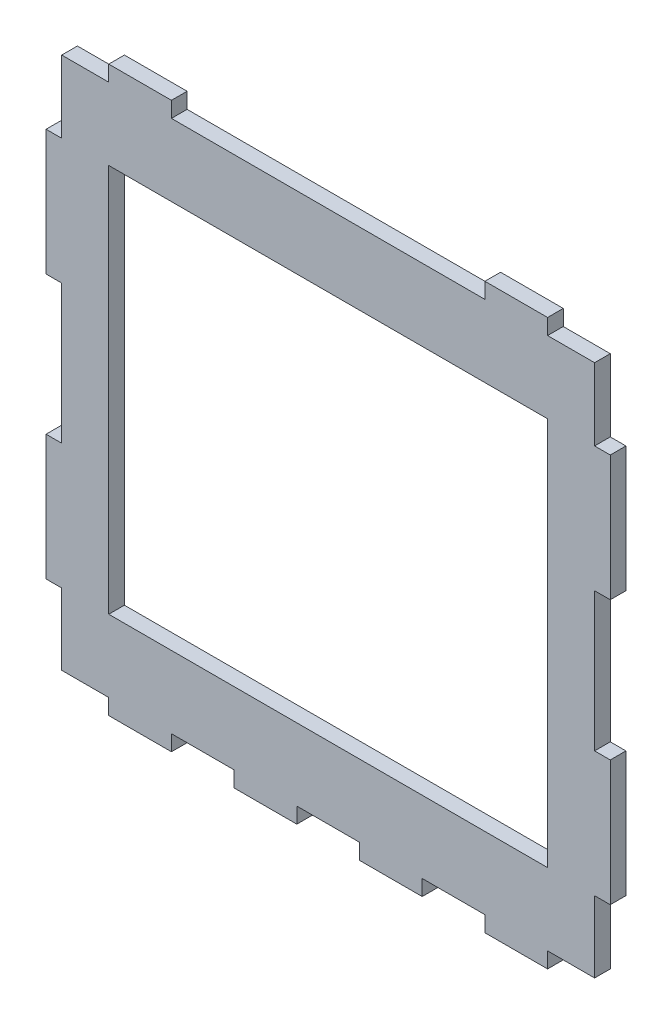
ISO-10303-21;
HEADER;
FILE_DESCRIPTION(('STEP AP214'),'2;1');
FILE_NAME('part.step','',(''),(''),'','','');
FILE_SCHEMA(('AUTOMOTIVE_DESIGN { 1 0 10303 214 1 1 1 1 }'));
ENDSEC;
DATA;
#1=APPLICATION_CONTEXT('core data for automotive mechanical design processes');
#2=APPLICATION_PROTOCOL_DEFINITION('international standard','automotive_design',2000,#1);
#3=PRODUCT_CONTEXT('',#1,'mechanical');
#4=PRODUCT('Part','Part','',(#3));
#5=PRODUCT_RELATED_PRODUCT_CATEGORY('part','',(#4));
#6=PRODUCT_DEFINITION_FORMATION('','',#4);
#7=PRODUCT_DEFINITION_CONTEXT('part definition',#1,'design');
#8=PRODUCT_DEFINITION('design','',#6,#7);
#9=PRODUCT_DEFINITION_SHAPE('','',#8);
#10=(LENGTH_UNIT() NAMED_UNIT(*) SI_UNIT(.MILLI.,.METRE.));
#11=(NAMED_UNIT(*) PLANE_ANGLE_UNIT() SI_UNIT($,.RADIAN.));
#12=(NAMED_UNIT(*) SI_UNIT($,.STERADIAN.) SOLID_ANGLE_UNIT());
#13=UNCERTAINTY_MEASURE_WITH_UNIT(LENGTH_MEASURE(1.E-05),#10,'distance_accuracy_value','');
#14=(GEOMETRIC_REPRESENTATION_CONTEXT(3) GLOBAL_UNCERTAINTY_ASSIGNED_CONTEXT((#13)) GLOBAL_UNIT_ASSIGNED_CONTEXT((#10,
#11,#12)) REPRESENTATION_CONTEXT('',''));
#15=CARTESIAN_POINT('',(0.,0.,0.));
#16=DIRECTION('',(0.,0.,1.));
#17=DIRECTION('',(1.,0.,0.));
#18=AXIS2_PLACEMENT_3D('',#15,#16,#17);
#19=CARTESIAN_POINT('',(0.,111.125,3.175));
#20=DIRECTION('',(0.,1.,0.));
#21=DIRECTION('',(0.,0.,1.));
#22=AXIS2_PLACEMENT_3D('',#19,#20,#21);
#23=PLANE('',#22);
#24=DIRECTION('',(1.,0.,0.));
#25=VECTOR('',#24,1.);
#26=CARTESIAN_POINT('',(0.,111.125,0.));
#27=LINE('',#26,#25);
#28=CARTESIAN_POINT('',(-111.125,111.125,0.));
#29=VERTEX_POINT('',#28);
#30=CARTESIAN_POINT('',(-101.6,111.125,0.));
#31=VERTEX_POINT('',#30);
#32=EDGE_CURVE('E684',#29,#31,#27,.T.);
#33=ORIENTED_EDGE('',*,*,#32,.F.);
#34=DIRECTION('',(0.,0.,1.));
#35=VECTOR('',#34,1.);
#36=CARTESIAN_POINT('',(-111.125,111.125,0.));
#37=LINE('',#36,#35);
#38=CARTESIAN_POINT('',(-111.125,111.125,3.175));
#39=VERTEX_POINT('',#38);
#40=EDGE_CURVE('E521',#29,#39,#37,.T.);
#41=ORIENTED_EDGE('',*,*,#40,.T.);
#42=DIRECTION('',(1.,0.,0.));
#43=VECTOR('',#42,1.);
#44=CARTESIAN_POINT('',(0.,111.125,3.175));
#45=LINE('',#44,#43);
#46=CARTESIAN_POINT('',(-101.6,111.125,3.175));
#47=VERTEX_POINT('',#46);
#48=EDGE_CURVE('E571',#39,#47,#45,.T.);
#49=ORIENTED_EDGE('',*,*,#48,.T.);
#50=DIRECTION('',(0.,0.,-1.));
#51=VECTOR('',#50,1.);
#52=CARTESIAN_POINT('',(-101.6,111.125,3.175));
#53=LINE('',#52,#51);
#54=EDGE_CURVE('E827',#47,#31,#53,.T.);
#55=ORIENTED_EDGE('',*,*,#54,.T.);
#56=EDGE_LOOP('',(#33,#41,#49,#55));
#57=FACE_BOUND('',#56,.T.);
#58=ADVANCED_FACE('F49',(#57),#23,.T.);
#59=CARTESIAN_POINT('',(-114.3,0.,3.175));
#60=DIRECTION('',(-1.,0.,0.));
#61=DIRECTION('',(0.,0.,1.));
#62=AXIS2_PLACEMENT_3D('',#59,#60,#61);
#63=PLANE('',#62);
#64=DIRECTION('',(0.,1.,0.));
#65=VECTOR('',#64,1.);
#66=CARTESIAN_POINT('',(-114.3,0.,0.));
#67=LINE('',#66,#65);
#68=CARTESIAN_POINT('',(-114.3,17.62,0.));
#69=VERTEX_POINT('',#68);
#70=CARTESIAN_POINT('',(-114.3,43.02,0.));
#71=VERTEX_POINT('',#70);
#72=EDGE_CURVE('E690',#69,#71,#67,.T.);
#73=ORIENTED_EDGE('',*,*,#72,.F.);
#74=DIRECTION('',(0.,0.,1.));
#75=VECTOR('',#74,1.);
#76=CARTESIAN_POINT('',(-114.3,17.62,0.));
#77=LINE('',#76,#75);
#78=CARTESIAN_POINT('',(-114.3,17.62,3.175));
#79=VERTEX_POINT('',#78);
#80=EDGE_CURVE('E426',#69,#79,#77,.T.);
#81=ORIENTED_EDGE('',*,*,#80,.T.);
#82=DIRECTION('',(0.,1.,0.));
#83=VECTOR('',#82,1.);
#84=CARTESIAN_POINT('',(-114.3,0.,3.175));
#85=LINE('',#84,#83);
#86=CARTESIAN_POINT('',(-114.3,43.02,3.175));
#87=VERTEX_POINT('',#86);
#88=EDGE_CURVE('E578',#79,#87,#85,.T.);
#89=ORIENTED_EDGE('',*,*,#88,.T.);
#90=DIRECTION('',(0.,0.,1.));
#91=VECTOR('',#90,1.);
#92=CARTESIAN_POINT('',(-114.3,43.02,0.));
#93=LINE('',#92,#91);
#94=EDGE_CURVE('E403',#71,#87,#93,.T.);
#95=ORIENTED_EDGE('',*,*,#94,.F.);
#96=EDGE_LOOP('',(#73,#81,#89,#95));
#97=FACE_BOUND('',#96,.T.);
#98=ADVANCED_FACE('F873',(#97),#63,.T.);
#99=CARTESIAN_POINT('',(0.,3.175,3.175));
#100=DIRECTION('',(0.,-1.,0.));
#101=DIRECTION('',(1.,0.,0.));
#102=AXIS2_PLACEMENT_3D('',#99,#100,#101);
#103=PLANE('',#102);
#104=DIRECTION('',(-1.,0.,0.));
#105=VECTOR('',#104,1.);
#106=CARTESIAN_POINT('',(0.,3.175,3.175));
#107=LINE('',#106,#105);
#108=CARTESIAN_POINT('',(-101.6,3.17499999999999,3.175));
#109=VERTEX_POINT('',#108);
#110=CARTESIAN_POINT('',(-111.125,3.17499999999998,3.175));
#111=VERTEX_POINT('',#110);
#112=EDGE_CURVE('E579',#109,#111,#107,.T.);
#113=ORIENTED_EDGE('',*,*,#112,.T.);
#114=DIRECTION('',(0.,0.,1.));
#115=VECTOR('',#114,1.);
#116=CARTESIAN_POINT('',(-111.125,3.17499999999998,0.));
#117=LINE('',#116,#115);
#118=CARTESIAN_POINT('',(-111.125,3.17499999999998,0.));
#119=VERTEX_POINT('',#118);
#120=EDGE_CURVE('E396',#119,#111,#117,.T.);
#121=ORIENTED_EDGE('',*,*,#120,.F.);
#122=DIRECTION('',(-1.,0.,0.));
#123=VECTOR('',#122,1.);
#124=CARTESIAN_POINT('',(0.,3.175,0.));
#125=LINE('',#124,#123);
#126=CARTESIAN_POINT('',(-101.6,3.17499999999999,0.));
#127=VERTEX_POINT('',#126);
#128=EDGE_CURVE('E691',#127,#119,#125,.T.);
#129=ORIENTED_EDGE('',*,*,#128,.F.);
#130=DIRECTION('',(0.,0.,-1.));
#131=VECTOR('',#130,1.);
#132=CARTESIAN_POINT('',(-101.6,3.17499999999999,3.175));
#133=LINE('',#132,#131);
#134=EDGE_CURVE('E824',#109,#127,#133,.T.);
#135=ORIENTED_EDGE('',*,*,#134,.F.);
#136=EDGE_LOOP('',(#113,#121,#129,#135));
#137=FACE_BOUND('',#136,.T.);
#138=ADVANCED_FACE('F880',(#137),#103,.T.);
#139=CARTESIAN_POINT('',(0.,0.,3.175));
#140=DIRECTION('',(-1.,0.,0.));
#141=DIRECTION('',(0.,0.,1.));
#142=AXIS2_PLACEMENT_3D('',#139,#140,#141);
#143=PLANE('',#142);
#144=DIRECTION('',(0.,0.,1.));
#145=VECTOR('',#144,1.);
#146=CARTESIAN_POINT('',(0.,96.52,0.));
#147=LINE('',#146,#145);
#148=CARTESIAN_POINT('',(0.,96.52,0.));
#149=VERTEX_POINT('',#148);
#150=CARTESIAN_POINT('',(0.,96.52,3.175));
#151=VERTEX_POINT('',#150);
#152=EDGE_CURVE('E473',#149,#151,#147,.T.);
#153=ORIENTED_EDGE('',*,*,#152,.T.);
#154=DIRECTION('',(0.,1.,0.));
#155=VECTOR('',#154,1.);
#156=CARTESIAN_POINT('',(0.,0.,3.175));
#157=LINE('',#156,#155);
#158=CARTESIAN_POINT('',(0.,71.12,3.175));
#159=VERTEX_POINT('',#158);
#160=EDGE_CURVE('E635',#159,#151,#157,.T.);
#161=ORIENTED_EDGE('',*,*,#160,.F.);
#162=DIRECTION('',(0.,0.,1.));
#163=VECTOR('',#162,1.);
#164=CARTESIAN_POINT('',(0.,71.12,0.));
#165=LINE('',#164,#163);
#166=CARTESIAN_POINT('',(0.,71.12,0.));
#167=VERTEX_POINT('',#166);
#168=EDGE_CURVE('E446',#167,#159,#165,.T.);
#169=ORIENTED_EDGE('',*,*,#168,.F.);
#170=DIRECTION('',(0.,1.,0.));
#171=VECTOR('',#170,1.);
#172=CARTESIAN_POINT('',(0.,0.,0.));
#173=LINE('',#172,#171);
#174=EDGE_CURVE('E750',#167,#149,#173,.T.);
#175=ORIENTED_EDGE('',*,*,#174,.T.);
#176=EDGE_LOOP('',(#153,#161,#169,#175));
#177=FACE_BOUND('',#176,.T.);
#178=ADVANCED_FACE('F960',(#177),#143,.F.);
#179=CARTESIAN_POINT('',(0.,0.,3.175));
#180=DIRECTION('',(0.,0.,1.));
#181=DIRECTION('',(1.,0.,0.));
#182=AXIS2_PLACEMENT_3D('',#179,#180,#181);
#183=PLANE('',#182);
#184=DIRECTION('',(1.,0.,0.));
#185=VECTOR('',#184,1.);
#186=CARTESIAN_POINT('',(0.,96.52,3.175));
#187=LINE('',#186,#185);
#188=CARTESIAN_POINT('',(-101.6,96.52,3.175));
#189=VERTEX_POINT('',#188);
#190=CARTESIAN_POINT('',(-12.7,96.52,3.175));
#191=VERTEX_POINT('',#190);
#192=EDGE_CURVE('E538',#189,#191,#187,.T.);
#193=ORIENTED_EDGE('',*,*,#192,.T.);
#194=DIRECTION('',(0.,-1.,0.));
#195=VECTOR('',#194,1.);
#196=CARTESIAN_POINT('',(-12.7,0.,3.175));
#197=LINE('',#196,#195);
#198=CARTESIAN_POINT('',(-12.7,17.78,3.175));
#199=VERTEX_POINT('',#198);
#200=EDGE_CURVE('E542',#191,#199,#197,.T.);
#201=ORIENTED_EDGE('',*,*,#200,.T.);
#202=DIRECTION('',(1.,0.,0.));
#203=VECTOR('',#202,1.);
#204=CARTESIAN_POINT('',(0.,17.78,3.175));
#205=LINE('',#204,#203);
#206=CARTESIAN_POINT('',(-101.6,17.78,3.175));
#207=VERTEX_POINT('',#206);
#208=EDGE_CURVE('E546',#207,#199,#205,.T.);
#209=ORIENTED_EDGE('',*,*,#208,.F.);
#210=DIRECTION('',(0.,-1.,0.));
#211=VECTOR('',#210,1.);
#212=CARTESIAN_POINT('',(-101.6,0.,3.175));
#213=LINE('',#212,#211);
#214=EDGE_CURVE('E550',#189,#207,#213,.T.);
#215=ORIENTED_EDGE('',*,*,#214,.F.);
#216=EDGE_LOOP('',(#193,#201,#209,#215));
#217=FACE_BOUND('',#216,.T.);
#218=ORIENTED_EDGE('',*,*,#160,.T.);
#219=DIRECTION('',(-1.,0.,0.));
#220=VECTOR('',#219,1.);
#221=CARTESIAN_POINT('',(0.,96.52,3.175));
#222=LINE('',#221,#220);
#223=CARTESIAN_POINT('',(-3.175,96.52,3.175));
#224=VERTEX_POINT('',#223);
#225=EDGE_CURVE('E495',#151,#224,#222,.T.);
#226=ORIENTED_EDGE('',*,*,#225,.T.);
#227=DIRECTION('',(0.,-1.,0.));
#228=VECTOR('',#227,1.);
#229=CARTESIAN_POINT('',(-3.175,0.,3.175));
#230=LINE('',#229,#228);
#231=CARTESIAN_POINT('',(-3.17500000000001,111.125,3.175));
#232=VERTEX_POINT('',#231);
#233=EDGE_CURVE('E499',#232,#224,#230,.T.);
#234=ORIENTED_EDGE('',*,*,#233,.F.);
#235=DIRECTION('',(1.,0.,0.));
#236=VECTOR('',#235,1.);
#237=CARTESIAN_POINT('',(0.,111.125,3.175));
#238=LINE('',#237,#236);
#239=CARTESIAN_POINT('',(-12.7,111.125,3.175));
#240=VERTEX_POINT('',#239);
#241=EDGE_CURVE('E559',#240,#232,#238,.T.);
#242=ORIENTED_EDGE('',*,*,#241,.F.);
#243=DIRECTION('',(0.,-1.,0.));
#244=VECTOR('',#243,1.);
#245=CARTESIAN_POINT('',(-12.7,0.,3.175));
#246=LINE('',#245,#244);
#247=CARTESIAN_POINT('',(-12.7,114.3,3.175));
#248=VERTEX_POINT('',#247);
#249=EDGE_CURVE('E640',#248,#240,#246,.T.);
#250=ORIENTED_EDGE('',*,*,#249,.F.);
#251=DIRECTION('',(-1.,0.,0.));
#252=VECTOR('',#251,1.);
#253=CARTESIAN_POINT('',(0.,114.3,3.175));
#254=LINE('',#253,#252);
#255=CARTESIAN_POINT('',(-25.4,114.3,3.175));
#256=VERTEX_POINT('',#255);
#257=EDGE_CURVE('E644',#248,#256,#254,.T.);
#258=ORIENTED_EDGE('',*,*,#257,.T.);
#259=DIRECTION('',(0.,1.,0.));
#260=VECTOR('',#259,1.);
#261=CARTESIAN_POINT('',(-25.4,0.,3.175));
#262=LINE('',#261,#260);
#263=CARTESIAN_POINT('',(-25.4,111.125,3.175));
#264=VERTEX_POINT('',#263);
#265=EDGE_CURVE('E647',#264,#256,#262,.T.);
#266=ORIENTED_EDGE('',*,*,#265,.F.);
#267=CARTESIAN_POINT('',(-88.9,111.125,3.175));
#268=VERTEX_POINT('',#267);
#269=EDGE_CURVE('E554',#268,#264,#238,.T.);
#270=ORIENTED_EDGE('',*,*,#269,.F.);
#271=DIRECTION('',(0.,1.,0.));
#272=VECTOR('',#271,1.);
#273=CARTESIAN_POINT('',(-88.9,0.,3.175));
#274=LINE('',#273,#272);
#275=CARTESIAN_POINT('',(-88.9,114.3,3.175));
#276=VERTEX_POINT('',#275);
#277=EDGE_CURVE('E558',#268,#276,#274,.T.);
#278=ORIENTED_EDGE('',*,*,#277,.T.);
#279=DIRECTION('',(-1.,0.,0.));
#280=VECTOR('',#279,1.);
#281=CARTESIAN_POINT('',(0.,114.3,3.175));
#282=LINE('',#281,#280);
#283=CARTESIAN_POINT('',(-101.6,114.3,3.175));
#284=VERTEX_POINT('',#283);
#285=EDGE_CURVE('E563',#276,#284,#282,.T.);
#286=ORIENTED_EDGE('',*,*,#285,.T.);
#287=DIRECTION('',(0.,-1.,0.));
#288=VECTOR('',#287,1.);
#289=CARTESIAN_POINT('',(-101.6,0.,3.175));
#290=LINE('',#289,#288);
#291=EDGE_CURVE('E567',#284,#47,#290,.T.);
#292=ORIENTED_EDGE('',*,*,#291,.T.);
#293=ORIENTED_EDGE('',*,*,#48,.F.);
#294=DIRECTION('',(0.,-1.,0.));
#295=VECTOR('',#294,1.);
#296=CARTESIAN_POINT('',(-111.125,0.,3.175));
#297=LINE('',#296,#295);
#298=CARTESIAN_POINT('',(-111.125,96.52,3.175));
#299=VERTEX_POINT('',#298);
#300=EDGE_CURVE('E402',#39,#299,#297,.T.);
#301=ORIENTED_EDGE('',*,*,#300,.T.);
#302=DIRECTION('',(1.,0.,0.));
#303=VECTOR('',#302,1.);
#304=CARTESIAN_POINT('',(0.,96.52,3.175));
#305=LINE('',#304,#303);
#306=CARTESIAN_POINT('',(-114.3,96.52,3.175));
#307=VERTEX_POINT('',#306);
#308=EDGE_CURVE('E517',#307,#299,#305,.T.);
#309=ORIENTED_EDGE('',*,*,#308,.F.);
#310=CARTESIAN_POINT('',(-114.3,71.12,3.175));
#311=VERTEX_POINT('',#310);
#312=EDGE_CURVE('E574',#311,#307,#85,.T.);
#313=ORIENTED_EDGE('',*,*,#312,.F.);
#314=DIRECTION('',(-1.,0.,0.));
#315=VECTOR('',#314,1.);
#316=CARTESIAN_POINT('',(0.,71.12,3.175));
#317=LINE('',#316,#315);
#318=CARTESIAN_POINT('',(-111.125,71.12,3.175));
#319=VERTEX_POINT('',#318);
#320=EDGE_CURVE('E389',#319,#311,#317,.T.);
#321=ORIENTED_EDGE('',*,*,#320,.F.);
#322=DIRECTION('',(0.,-1.,0.));
#323=VECTOR('',#322,1.);
#324=CARTESIAN_POINT('',(-111.125,0.,3.175));
#325=LINE('',#324,#323);
#326=CARTESIAN_POINT('',(-111.125,43.02,3.175));
#327=VERTEX_POINT('',#326);
#328=EDGE_CURVE('E363',#319,#327,#325,.T.);
#329=ORIENTED_EDGE('',*,*,#328,.T.);
#330=DIRECTION('',(-1.,0.,0.));
#331=VECTOR('',#330,1.);
#332=CARTESIAN_POINT('',(0.,43.02,3.175));
#333=LINE('',#332,#331);
#334=EDGE_CURVE('E384',#327,#87,#333,.T.);
#335=ORIENTED_EDGE('',*,*,#334,.T.);
#336=ORIENTED_EDGE('',*,*,#88,.F.);
#337=DIRECTION('',(1.,0.,0.));
#338=VECTOR('',#337,1.);
#339=CARTESIAN_POINT('',(0.,17.62,3.175));
#340=LINE('',#339,#338);
#341=CARTESIAN_POINT('',(-111.125,17.62,3.175));
#342=VERTEX_POINT('',#341);
#343=EDGE_CURVE('E412',#79,#342,#340,.T.);
#344=ORIENTED_EDGE('',*,*,#343,.T.);
#345=DIRECTION('',(0.,-1.,0.));
#346=VECTOR('',#345,1.);
#347=CARTESIAN_POINT('',(-111.125,0.,3.175));
#348=LINE('',#347,#346);
#349=EDGE_CURVE('E416',#342,#111,#348,.T.);
#350=ORIENTED_EDGE('',*,*,#349,.T.);
#351=ORIENTED_EDGE('',*,*,#112,.F.);
#352=DIRECTION('',(0.,1.,0.));
#353=VECTOR('',#352,1.);
#354=CARTESIAN_POINT('',(-101.6,4.44089209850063E-13,3.175));
#355=LINE('',#354,#353);
#356=CARTESIAN_POINT('',(-101.6,0.,3.175));
#357=VERTEX_POINT('',#356);
#358=EDGE_CURVE('E583',#357,#109,#355,.T.);
#359=ORIENTED_EDGE('',*,*,#358,.F.);
#360=DIRECTION('',(-1.,0.,0.));
#361=VECTOR('',#360,1.);
#362=CARTESIAN_POINT('',(0.,0.,3.175));
#363=LINE('',#362,#361);
#364=CARTESIAN_POINT('',(-88.9,0.,3.175));
#365=VERTEX_POINT('',#364);
#366=EDGE_CURVE('E589',#365,#357,#363,.T.);
#367=ORIENTED_EDGE('',*,*,#366,.F.);
#368=DIRECTION('',(0.,-1.,0.));
#369=VECTOR('',#368,1.);
#370=CARTESIAN_POINT('',(-88.9,0.,3.175));
#371=LINE('',#370,#369);
#372=CARTESIAN_POINT('',(-88.9,3.17499999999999,3.175));
#373=VERTEX_POINT('',#372);
#374=EDGE_CURVE('E593',#373,#365,#371,.T.);
#375=ORIENTED_EDGE('',*,*,#374,.F.);
#376=CARTESIAN_POINT('',(-76.2,3.17499999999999,3.175));
#377=VERTEX_POINT('',#376);
#378=EDGE_CURVE('E585',#377,#373,#107,.T.);
#379=ORIENTED_EDGE('',*,*,#378,.F.);
#380=DIRECTION('',(0.,-1.,0.));
#381=VECTOR('',#380,1.);
#382=CARTESIAN_POINT('',(-76.2,-3.33066907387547E-13,3.175));
#383=LINE('',#382,#381);
#384=CARTESIAN_POINT('',(-76.2,0.,3.175));
#385=VERTEX_POINT('',#384);
#386=EDGE_CURVE('E597',#377,#385,#383,.T.);
#387=ORIENTED_EDGE('',*,*,#386,.T.);
#388=DIRECTION('',(-1.,0.,0.));
#389=VECTOR('',#388,1.);
#390=CARTESIAN_POINT('',(0.,0.,3.175));
#391=LINE('',#390,#389);
#392=CARTESIAN_POINT('',(-63.5,0.,3.175));
#393=VERTEX_POINT('',#392);
#394=EDGE_CURVE('E600',#393,#385,#391,.T.);
#395=ORIENTED_EDGE('',*,*,#394,.F.);
#396=DIRECTION('',(0.,-1.,0.));
#397=VECTOR('',#396,1.);
#398=CARTESIAN_POINT('',(-63.5,-2.77555756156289E-13,3.175));
#399=LINE('',#398,#397);
#400=CARTESIAN_POINT('',(-63.5,3.17499999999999,3.175));
#401=VERTEX_POINT('',#400);
#402=EDGE_CURVE('E604',#401,#393,#399,.T.);
#403=ORIENTED_EDGE('',*,*,#402,.F.);
#404=CARTESIAN_POINT('',(-50.8,3.17499999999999,3.175));
#405=VERTEX_POINT('',#404);
#406=EDGE_CURVE('E584',#405,#401,#107,.T.);
#407=ORIENTED_EDGE('',*,*,#406,.F.);
#408=DIRECTION('',(0.,-1.,0.));
#409=VECTOR('',#408,1.);
#410=CARTESIAN_POINT('',(-50.8,-1.11022302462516E-13,3.175));
#411=LINE('',#410,#409);
#412=CARTESIAN_POINT('',(-50.8,0.,3.175));
#413=VERTEX_POINT('',#412);
#414=EDGE_CURVE('E608',#405,#413,#411,.T.);
#415=ORIENTED_EDGE('',*,*,#414,.T.);
#416=DIRECTION('',(-1.,0.,0.));
#417=VECTOR('',#416,1.);
#418=CARTESIAN_POINT('',(0.,0.,3.175));
#419=LINE('',#418,#417);
#420=CARTESIAN_POINT('',(-38.1,0.,3.175));
#421=VERTEX_POINT('',#420);
#422=EDGE_CURVE('E611',#421,#413,#419,.T.);
#423=ORIENTED_EDGE('',*,*,#422,.F.);
#424=DIRECTION('',(0.,-1.,0.));
#425=VECTOR('',#424,1.);
#426=CARTESIAN_POINT('',(-38.1,-1.66533453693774E-13,3.175));
#427=LINE('',#426,#425);
#428=CARTESIAN_POINT('',(-38.1,3.17499999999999,3.175));
#429=VERTEX_POINT('',#428);
#430=EDGE_CURVE('E615',#429,#421,#427,.T.);
#431=ORIENTED_EDGE('',*,*,#430,.F.);
#432=DIRECTION('',(1.,0.,0.));
#433=VECTOR('',#432,1.);
#434=CARTESIAN_POINT('',(0.,3.17499999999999,3.175));
#435=LINE('',#434,#433);
#436=CARTESIAN_POINT('',(-25.4,3.17499999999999,3.175));
#437=VERTEX_POINT('',#436);
#438=EDGE_CURVE('E619',#429,#437,#435,.T.);
#439=ORIENTED_EDGE('',*,*,#438,.T.);
#440=DIRECTION('',(0.,-1.,0.));
#441=VECTOR('',#440,1.);
#442=CARTESIAN_POINT('',(-25.4,-2.22044604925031E-13,3.175));
#443=LINE('',#442,#441);
#444=CARTESIAN_POINT('',(-25.4,0.,3.175));
#445=VERTEX_POINT('',#444);
#446=EDGE_CURVE('E623',#437,#445,#443,.T.);
#447=ORIENTED_EDGE('',*,*,#446,.T.);
#448=DIRECTION('',(-1.,0.,0.));
#449=VECTOR('',#448,1.);
#450=CARTESIAN_POINT('',(0.,0.,3.175));
#451=LINE('',#450,#449);
#452=CARTESIAN_POINT('',(-12.7,0.,3.175));
#453=VERTEX_POINT('',#452);
#454=EDGE_CURVE('E627',#453,#445,#451,.T.);
#455=ORIENTED_EDGE('',*,*,#454,.F.);
#456=DIRECTION('',(0.,-1.,0.));
#457=VECTOR('',#456,1.);
#458=CARTESIAN_POINT('',(-12.7,0.,3.175));
#459=LINE('',#458,#457);
#460=CARTESIAN_POINT('',(-12.7,3.17499999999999,3.175));
#461=VERTEX_POINT('',#460);
#462=EDGE_CURVE('E631',#461,#453,#459,.T.);
#463=ORIENTED_EDGE('',*,*,#462,.F.);
#464=CARTESIAN_POINT('',(-3.175,3.17499999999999,3.175));
#465=VERTEX_POINT('',#464);
#466=EDGE_CURVE('E624',#461,#465,#435,.T.);
#467=ORIENTED_EDGE('',*,*,#466,.T.);
#468=DIRECTION('',(0.,-1.,0.));
#469=VECTOR('',#468,1.);
#470=CARTESIAN_POINT('',(-3.175,0.,3.175));
#471=LINE('',#470,#469);
#472=CARTESIAN_POINT('',(-3.175,17.62,3.175));
#473=VERTEX_POINT('',#472);
#474=EDGE_CURVE('E437',#473,#465,#471,.T.);
#475=ORIENTED_EDGE('',*,*,#474,.F.);
#476=DIRECTION('',(-1.,0.,0.));
#477=VECTOR('',#476,1.);
#478=CARTESIAN_POINT('',(0.,17.62,3.175));
#479=LINE('',#478,#477);
#480=CARTESIAN_POINT('',(0.,17.62,3.175));
#481=VERTEX_POINT('',#480);
#482=EDGE_CURVE('E442',#481,#473,#479,.T.);
#483=ORIENTED_EDGE('',*,*,#482,.F.);
#484=CARTESIAN_POINT('',(0.,43.02,3.175));
#485=VERTEX_POINT('',#484);
#486=EDGE_CURVE('E639',#481,#485,#157,.T.);
#487=ORIENTED_EDGE('',*,*,#486,.T.);
#488=DIRECTION('',(1.,0.,0.));
#489=VECTOR('',#488,1.);
#490=CARTESIAN_POINT('',(0.,43.02,3.175));
#491=LINE('',#490,#489);
#492=CARTESIAN_POINT('',(-3.17500000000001,43.02,3.175));
#493=VERTEX_POINT('',#492);
#494=EDGE_CURVE('E461',#493,#485,#491,.T.);
#495=ORIENTED_EDGE('',*,*,#494,.F.);
#496=DIRECTION('',(0.,-1.,0.));
#497=VECTOR('',#496,1.);
#498=CARTESIAN_POINT('',(-3.175,0.,3.175));
#499=LINE('',#498,#497);
#500=CARTESIAN_POINT('',(-3.175,71.12,3.175));
#501=VERTEX_POINT('',#500);
#502=EDGE_CURVE('E472',#501,#493,#499,.T.);
#503=ORIENTED_EDGE('',*,*,#502,.F.);
#504=DIRECTION('',(1.,0.,0.));
#505=VECTOR('',#504,1.);
#506=CARTESIAN_POINT('',(0.,71.12,3.175));
#507=LINE('',#506,#505);
#508=EDGE_CURVE('E468',#501,#159,#507,.T.);
#509=ORIENTED_EDGE('',*,*,#508,.T.);
#510=EDGE_LOOP('',(#218,#226,#234,#242,#250,#258,#266,#270,#278,#286,#292,#293,#301,#309,#313,
#321,#329,#335,#336,#344,#350,#351,#359,#367,#375,#379,#387,#395,#403,#407,#415,#423,#431,#439,
#447,#455,#463,#467,#475,#483,#487,#495,#503,#509));
#511=FACE_BOUND('',#510,.T.);
#512=ADVANCED_FACE('F948',(#217,#511),#183,.T.);
#513=CARTESIAN_POINT('',(0.,0.,0.));
#514=DIRECTION('',(0.,0.,1.));
#515=DIRECTION('',(1.,0.,0.));
#516=AXIS2_PLACEMENT_3D('',#513,#514,#515);
#517=PLANE('',#516);
#518=DIRECTION('',(1.,0.,0.));
#519=VECTOR('',#518,1.);
#520=CARTESIAN_POINT('',(0.,96.52,0.));
#521=LINE('',#520,#519);
#522=CARTESIAN_POINT('',(-101.6,96.52,0.));
#523=VERTEX_POINT('',#522);
#524=CARTESIAN_POINT('',(-12.7,96.52,0.));
#525=VERTEX_POINT('',#524);
#526=EDGE_CURVE('E531',#523,#525,#521,.T.);
#527=ORIENTED_EDGE('',*,*,#526,.F.);
#528=DIRECTION('',(0.,-1.,0.));
#529=VECTOR('',#528,1.);
#530=CARTESIAN_POINT('',(-101.6,0.,0.));
#531=LINE('',#530,#529);
#532=CARTESIAN_POINT('',(-101.6,17.78,0.));
#533=VERTEX_POINT('',#532);
#534=EDGE_CURVE('E663',#523,#533,#531,.T.);
#535=ORIENTED_EDGE('',*,*,#534,.T.);
#536=DIRECTION('',(1.,0.,0.));
#537=VECTOR('',#536,1.);
#538=CARTESIAN_POINT('',(0.,17.78,0.));
#539=LINE('',#538,#537);
#540=CARTESIAN_POINT('',(-12.7,17.78,0.));
#541=VERTEX_POINT('',#540);
#542=EDGE_CURVE('E659',#533,#541,#539,.T.);
#543=ORIENTED_EDGE('',*,*,#542,.T.);
#544=DIRECTION('',(0.,-1.,0.));
#545=VECTOR('',#544,1.);
#546=CARTESIAN_POINT('',(-12.7,0.,0.));
#547=LINE('',#546,#545);
#548=EDGE_CURVE('E655',#525,#541,#547,.T.);
#549=ORIENTED_EDGE('',*,*,#548,.F.);
#550=EDGE_LOOP('',(#527,#535,#543,#549));
#551=FACE_BOUND('',#550,.T.);
#552=DIRECTION('',(-1.,0.,0.));
#553=VECTOR('',#552,1.);
#554=CARTESIAN_POINT('',(0.,96.52,0.));
#555=LINE('',#554,#553);
#556=CARTESIAN_POINT('',(-3.17500000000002,96.52,0.));
#557=VERTEX_POINT('',#556);
#558=EDGE_CURVE('E494',#149,#557,#555,.T.);
#559=ORIENTED_EDGE('',*,*,#558,.F.);
#560=ORIENTED_EDGE('',*,*,#174,.F.);
#561=DIRECTION('',(1.,0.,0.));
#562=VECTOR('',#561,1.);
#563=CARTESIAN_POINT('',(0.,71.12,0.));
#564=LINE('',#563,#562);
#565=CARTESIAN_POINT('',(-3.175,71.12,0.));
#566=VERTEX_POINT('',#565);
#567=EDGE_CURVE('E457',#566,#167,#564,.T.);
#568=ORIENTED_EDGE('',*,*,#567,.F.);
#569=DIRECTION('',(0.,-1.,0.));
#570=VECTOR('',#569,1.);
#571=CARTESIAN_POINT('',(-3.175,0.,0.));
#572=LINE('',#571,#570);
#573=CARTESIAN_POINT('',(-3.17500000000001,43.02,0.));
#574=VERTEX_POINT('',#573);
#575=EDGE_CURVE('E460',#566,#574,#572,.T.);
#576=ORIENTED_EDGE('',*,*,#575,.T.);
#577=DIRECTION('',(1.,0.,0.));
#578=VECTOR('',#577,1.);
#579=CARTESIAN_POINT('',(0.,43.02,0.));
#580=LINE('',#579,#578);
#581=CARTESIAN_POINT('',(0.,43.02,0.));
#582=VERTEX_POINT('',#581);
#583=EDGE_CURVE('E75',#574,#582,#580,.T.);
#584=ORIENTED_EDGE('',*,*,#583,.T.);
#585=CARTESIAN_POINT('',(0.,17.62,0.));
#586=VERTEX_POINT('',#585);
#587=EDGE_CURVE('E754',#586,#582,#173,.T.);
#588=ORIENTED_EDGE('',*,*,#587,.F.);
#589=DIRECTION('',(-1.,0.,0.));
#590=VECTOR('',#589,1.);
#591=CARTESIAN_POINT('',(0.,17.62,0.));
#592=LINE('',#591,#590);
#593=CARTESIAN_POINT('',(-3.175,17.62,0.));
#594=VERTEX_POINT('',#593);
#595=EDGE_CURVE('E432',#586,#594,#592,.T.);
#596=ORIENTED_EDGE('',*,*,#595,.T.);
#597=DIRECTION('',(0.,-1.,0.));
#598=VECTOR('',#597,1.);
#599=CARTESIAN_POINT('',(-3.175,0.,0.));
#600=LINE('',#599,#598);
#601=CARTESIAN_POINT('',(-3.175,3.17499999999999,0.));
#602=VERTEX_POINT('',#601);
#603=EDGE_CURVE('E436',#594,#602,#600,.T.);
#604=ORIENTED_EDGE('',*,*,#603,.T.);
#605=DIRECTION('',(1.,0.,0.));
#606=VECTOR('',#605,1.);
#607=CARTESIAN_POINT('',(0.,3.17499999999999,0.));
#608=LINE('',#607,#606);
#609=CARTESIAN_POINT('',(-12.7,3.17499999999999,0.));
#610=VERTEX_POINT('',#609);
#611=EDGE_CURVE('E738',#610,#602,#608,.T.);
#612=ORIENTED_EDGE('',*,*,#611,.F.);
#613=DIRECTION('',(0.,-1.,0.));
#614=VECTOR('',#613,1.);
#615=CARTESIAN_POINT('',(-12.7,0.,0.));
#616=LINE('',#615,#614);
#617=CARTESIAN_POINT('',(-12.7,0.,0.));
#618=VERTEX_POINT('',#617);
#619=EDGE_CURVE('E746',#610,#618,#616,.T.);
#620=ORIENTED_EDGE('',*,*,#619,.T.);
#621=DIRECTION('',(-1.,0.,0.));
#622=VECTOR('',#621,1.);
#623=CARTESIAN_POINT('',(0.,0.,0.));
#624=LINE('',#623,#622);
#625=CARTESIAN_POINT('',(-25.4,0.,0.));
#626=VERTEX_POINT('',#625);
#627=EDGE_CURVE('E742',#618,#626,#624,.T.);
#628=ORIENTED_EDGE('',*,*,#627,.T.);
#629=DIRECTION('',(0.,-1.,0.));
#630=VECTOR('',#629,1.);
#631=CARTESIAN_POINT('',(-25.4,-2.22044604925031E-13,0.));
#632=LINE('',#631,#630);
#633=CARTESIAN_POINT('',(-25.4,3.17499999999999,0.));
#634=VERTEX_POINT('',#633);
#635=EDGE_CURVE('E737',#634,#626,#632,.T.);
#636=ORIENTED_EDGE('',*,*,#635,.F.);
#637=CARTESIAN_POINT('',(-38.1,3.17499999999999,0.));
#638=VERTEX_POINT('',#637);
#639=EDGE_CURVE('E733',#638,#634,#608,.T.);
#640=ORIENTED_EDGE('',*,*,#639,.F.);
#641=DIRECTION('',(0.,-1.,0.));
#642=VECTOR('',#641,1.);
#643=CARTESIAN_POINT('',(-38.1,-1.66533453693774E-13,0.));
#644=LINE('',#643,#642);
#645=CARTESIAN_POINT('',(-38.1,0.,0.));
#646=VERTEX_POINT('',#645);
#647=EDGE_CURVE('E729',#638,#646,#644,.T.);
#648=ORIENTED_EDGE('',*,*,#647,.T.);
#649=DIRECTION('',(-1.,0.,0.));
#650=VECTOR('',#649,1.);
#651=CARTESIAN_POINT('',(0.,0.,0.));
#652=LINE('',#651,#650);
#653=CARTESIAN_POINT('',(-50.8,0.,0.));
#654=VERTEX_POINT('',#653);
#655=EDGE_CURVE('E725',#646,#654,#652,.T.);
#656=ORIENTED_EDGE('',*,*,#655,.T.);
#657=DIRECTION('',(0.,-1.,0.));
#658=VECTOR('',#657,1.);
#659=CARTESIAN_POINT('',(-50.8,-1.11022302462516E-13,0.));
#660=LINE('',#659,#658);
#661=CARTESIAN_POINT('',(-50.8,3.17499999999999,0.));
#662=VERTEX_POINT('',#661);
#663=EDGE_CURVE('E721',#662,#654,#660,.T.);
#664=ORIENTED_EDGE('',*,*,#663,.F.);
#665=CARTESIAN_POINT('',(-63.5,3.17499999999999,0.));
#666=VERTEX_POINT('',#665);
#667=EDGE_CURVE('E696',#662,#666,#125,.T.);
#668=ORIENTED_EDGE('',*,*,#667,.T.);
#669=DIRECTION('',(0.,-1.,0.));
#670=VECTOR('',#669,1.);
#671=CARTESIAN_POINT('',(-63.5,-2.77555756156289E-13,0.));
#672=LINE('',#671,#670);
#673=CARTESIAN_POINT('',(-63.5,0.,0.));
#674=VERTEX_POINT('',#673);
#675=EDGE_CURVE('E717',#666,#674,#672,.T.);
#676=ORIENTED_EDGE('',*,*,#675,.T.);
#677=DIRECTION('',(-1.,0.,0.));
#678=VECTOR('',#677,1.);
#679=CARTESIAN_POINT('',(0.,0.,0.));
#680=LINE('',#679,#678);
#681=CARTESIAN_POINT('',(-76.2,0.,0.));
#682=VERTEX_POINT('',#681);
#683=EDGE_CURVE('E713',#674,#682,#680,.T.);
#684=ORIENTED_EDGE('',*,*,#683,.T.);
#685=DIRECTION('',(0.,-1.,0.));
#686=VECTOR('',#685,1.);
#687=CARTESIAN_POINT('',(-76.2,-3.33066907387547E-13,0.));
#688=LINE('',#687,#686);
#689=CARTESIAN_POINT('',(-76.2,3.17499999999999,0.));
#690=VERTEX_POINT('',#689);
#691=EDGE_CURVE('E709',#690,#682,#688,.T.);
#692=ORIENTED_EDGE('',*,*,#691,.F.);
#693=CARTESIAN_POINT('',(-88.9,3.17499999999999,0.));
#694=VERTEX_POINT('',#693);
#695=EDGE_CURVE('E697',#690,#694,#125,.T.);
#696=ORIENTED_EDGE('',*,*,#695,.T.);
#697=DIRECTION('',(0.,-1.,0.));
#698=VECTOR('',#697,1.);
#699=CARTESIAN_POINT('',(-88.9,0.,0.));
#700=LINE('',#699,#698);
#701=CARTESIAN_POINT('',(-88.9,0.,0.));
#702=VERTEX_POINT('',#701);
#703=EDGE_CURVE('E705',#694,#702,#700,.T.);
#704=ORIENTED_EDGE('',*,*,#703,.T.);
#705=DIRECTION('',(-1.,0.,0.));
#706=VECTOR('',#705,1.);
#707=CARTESIAN_POINT('',(0.,0.,0.));
#708=LINE('',#707,#706);
#709=CARTESIAN_POINT('',(-101.6,0.,0.));
#710=VERTEX_POINT('',#709);
#711=EDGE_CURVE('E701',#702,#710,#708,.T.);
#712=ORIENTED_EDGE('',*,*,#711,.T.);
#713=DIRECTION('',(0.,1.,0.));
#714=VECTOR('',#713,1.);
#715=CARTESIAN_POINT('',(-101.6,4.44089209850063E-13,0.));
#716=LINE('',#715,#714);
#717=EDGE_CURVE('E695',#710,#127,#716,.T.);
#718=ORIENTED_EDGE('',*,*,#717,.T.);
#719=ORIENTED_EDGE('',*,*,#128,.T.);
#720=DIRECTION('',(0.,-1.,0.));
#721=VECTOR('',#720,1.);
#722=CARTESIAN_POINT('',(-111.125,0.,0.));
#723=LINE('',#722,#721);
#724=CARTESIAN_POINT('',(-111.125,17.62,0.));
#725=VERTEX_POINT('',#724);
#726=EDGE_CURVE('E408',#725,#119,#723,.T.);
#727=ORIENTED_EDGE('',*,*,#726,.F.);
#728=DIRECTION('',(1.,0.,0.));
#729=VECTOR('',#728,1.);
#730=CARTESIAN_POINT('',(0.,17.62,0.));
#731=LINE('',#730,#729);
#732=EDGE_CURVE('E411',#69,#725,#731,.T.);
#733=ORIENTED_EDGE('',*,*,#732,.F.);
#734=ORIENTED_EDGE('',*,*,#72,.T.);
#735=DIRECTION('',(-1.,0.,0.));
#736=VECTOR('',#735,1.);
#737=CARTESIAN_POINT('',(0.,43.02,0.));
#738=LINE('',#737,#736);
#739=CARTESIAN_POINT('',(-111.125,43.02,0.));
#740=VERTEX_POINT('',#739);
#741=EDGE_CURVE('E368',#740,#71,#738,.T.);
#742=ORIENTED_EDGE('',*,*,#741,.F.);
#743=DIRECTION('',(0.,-1.,0.));
#744=VECTOR('',#743,1.);
#745=CARTESIAN_POINT('',(-111.125,0.,0.));
#746=LINE('',#745,#744);
#747=CARTESIAN_POINT('',(-111.125,71.12,0.));
#748=VERTEX_POINT('',#747);
#749=EDGE_CURVE('E360',#748,#740,#746,.T.);
#750=ORIENTED_EDGE('',*,*,#749,.F.);
#751=DIRECTION('',(-1.,0.,0.));
#752=VECTOR('',#751,1.);
#753=CARTESIAN_POINT('',(0.,71.12,0.));
#754=LINE('',#753,#752);
#755=CARTESIAN_POINT('',(-114.3,71.12,0.));
#756=VERTEX_POINT('',#755);
#757=EDGE_CURVE('E371',#748,#756,#754,.T.);
#758=ORIENTED_EDGE('',*,*,#757,.T.);
#759=CARTESIAN_POINT('',(-114.3,96.52,0.));
#760=VERTEX_POINT('',#759);
#761=EDGE_CURVE('E687',#756,#760,#67,.T.);
#762=ORIENTED_EDGE('',*,*,#761,.T.);
#763=DIRECTION('',(1.,0.,0.));
#764=VECTOR('',#763,1.);
#765=CARTESIAN_POINT('',(0.,96.52,0.));
#766=LINE('',#765,#764);
#767=CARTESIAN_POINT('',(-111.125,96.52,0.));
#768=VERTEX_POINT('',#767);
#769=EDGE_CURVE('E516',#760,#768,#766,.T.);
#770=ORIENTED_EDGE('',*,*,#769,.T.);
#771=DIRECTION('',(0.,-1.,0.));
#772=VECTOR('',#771,1.);
#773=CARTESIAN_POINT('',(-111.125,0.,0.));
#774=LINE('',#773,#772);
#775=EDGE_CURVE('E512',#29,#768,#774,.T.);
#776=ORIENTED_EDGE('',*,*,#775,.F.);
#777=ORIENTED_EDGE('',*,*,#32,.T.);
#778=DIRECTION('',(0.,-1.,0.));
#779=VECTOR('',#778,1.);
#780=CARTESIAN_POINT('',(-101.6,0.,0.));
#781=LINE('',#780,#779);
#782=CARTESIAN_POINT('',(-101.6,114.3,0.));
#783=VERTEX_POINT('',#782);
#784=EDGE_CURVE('E680',#783,#31,#781,.T.);
#785=ORIENTED_EDGE('',*,*,#784,.F.);
#786=DIRECTION('',(-1.,0.,0.));
#787=VECTOR('',#786,1.);
#788=CARTESIAN_POINT('',(0.,114.3,0.));
#789=LINE('',#788,#787);
#790=CARTESIAN_POINT('',(-88.9,114.3,0.));
#791=VERTEX_POINT('',#790);
#792=EDGE_CURVE('E676',#791,#783,#789,.T.);
#793=ORIENTED_EDGE('',*,*,#792,.F.);
#794=DIRECTION('',(0.,1.,0.));
#795=VECTOR('',#794,1.);
#796=CARTESIAN_POINT('',(-88.9,0.,0.));
#797=LINE('',#796,#795);
#798=CARTESIAN_POINT('',(-88.9,111.125,0.));
#799=VERTEX_POINT('',#798);
#800=EDGE_CURVE('E671',#799,#791,#797,.T.);
#801=ORIENTED_EDGE('',*,*,#800,.F.);
#802=DIRECTION('',(1.,0.,0.));
#803=VECTOR('',#802,1.);
#804=CARTESIAN_POINT('',(0.,111.125,0.));
#805=LINE('',#804,#803);
#806=CARTESIAN_POINT('',(-25.4,111.125,0.));
#807=VERTEX_POINT('',#806);
#808=EDGE_CURVE('E667',#799,#807,#805,.T.);
#809=ORIENTED_EDGE('',*,*,#808,.T.);
#810=DIRECTION('',(0.,1.,0.));
#811=VECTOR('',#810,1.);
#812=CARTESIAN_POINT('',(-25.4,0.,0.));
#813=LINE('',#812,#811);
#814=CARTESIAN_POINT('',(-25.4,114.3,0.));
#815=VERTEX_POINT('',#814);
#816=EDGE_CURVE('E543',#807,#815,#813,.T.);
#817=ORIENTED_EDGE('',*,*,#816,.T.);
#818=DIRECTION('',(-1.,0.,0.));
#819=VECTOR('',#818,1.);
#820=CARTESIAN_POINT('',(0.,114.3,0.));
#821=LINE('',#820,#819);
#822=CARTESIAN_POINT('',(-12.7,114.3,0.));
#823=VERTEX_POINT('',#822);
#824=EDGE_CURVE('E759',#823,#815,#821,.T.);
#825=ORIENTED_EDGE('',*,*,#824,.F.);
#826=DIRECTION('',(0.,-1.,0.));
#827=VECTOR('',#826,1.);
#828=CARTESIAN_POINT('',(-12.7,0.,0.));
#829=LINE('',#828,#827);
#830=CARTESIAN_POINT('',(-12.7,111.125,0.));
#831=VERTEX_POINT('',#830);
#832=EDGE_CURVE('E755',#823,#831,#829,.T.);
#833=ORIENTED_EDGE('',*,*,#832,.T.);
#834=CARTESIAN_POINT('',(-3.17500000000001,111.125,0.));
#835=VERTEX_POINT('',#834);
#836=EDGE_CURVE('E672',#831,#835,#805,.T.);
#837=ORIENTED_EDGE('',*,*,#836,.T.);
#838=DIRECTION('',(0.,-1.,0.));
#839=VECTOR('',#838,1.);
#840=CARTESIAN_POINT('',(-3.175,0.,0.));
#841=LINE('',#840,#839);
#842=EDGE_CURVE('E490',#835,#557,#841,.T.);
#843=ORIENTED_EDGE('',*,*,#842,.T.);
#844=EDGE_LOOP('',(#559,#560,#568,#576,#584,#588,#596,#604,#612,#620,#628,#636,#640,#648,#656,
#664,#668,#676,#684,#692,#696,#704,#712,#718,#719,#727,#733,#734,#742,#750,#758,#762,#770,#776,
#777,#785,#793,#801,#809,#817,#825,#833,#837,#843));
#845=FACE_BOUND('',#844,.T.);
#846=ADVANCED_FACE('F381',(#551,#845),#517,.F.);
#847=CARTESIAN_POINT('',(0.,111.125,3.175));
#848=DIRECTION('',(0.,1.,0.));
#849=DIRECTION('',(0.,0.,1.));
#850=AXIS2_PLACEMENT_3D('',#847,#848,#849);
#851=PLANE('',#850);
#852=ORIENTED_EDGE('',*,*,#808,.F.);
#853=DIRECTION('',(0.,0.,-1.));
#854=VECTOR('',#853,1.);
#855=CARTESIAN_POINT('',(-88.9,111.125,3.175));
#856=LINE('',#855,#854);
#857=EDGE_CURVE('E11',#268,#799,#856,.T.);
#858=ORIENTED_EDGE('',*,*,#857,.F.);
#859=ORIENTED_EDGE('',*,*,#269,.T.);
#860=DIRECTION('',(0.,0.,-1.));
#861=VECTOR('',#860,1.);
#862=CARTESIAN_POINT('',(-25.4,111.125,3.175));
#863=LINE('',#862,#861);
#864=EDGE_CURVE('E766',#264,#807,#863,.T.);
#865=ORIENTED_EDGE('',*,*,#864,.T.);
#866=EDGE_LOOP('',(#852,#858,#859,#865));
#867=FACE_BOUND('',#866,.T.);
#868=ADVANCED_FACE('F897',(#867),#851,.T.);
#869=CARTESIAN_POINT('',(-88.9,0.,3.175));
#870=DIRECTION('',(-1.,0.,0.));
#871=DIRECTION('',(0.,0.,1.));
#872=AXIS2_PLACEMENT_3D('',#869,#870,#871);
#873=PLANE('',#872);
#874=ORIENTED_EDGE('',*,*,#800,.T.);
#875=DIRECTION('',(0.,0.,-1.));
#876=VECTOR('',#875,1.);
#877=CARTESIAN_POINT('',(-88.9,114.3,3.175));
#878=LINE('',#877,#876);
#879=EDGE_CURVE('E59',#276,#791,#878,.T.);
#880=ORIENTED_EDGE('',*,*,#879,.F.);
#881=ORIENTED_EDGE('',*,*,#277,.F.);
#882=ORIENTED_EDGE('',*,*,#857,.T.);
#883=EDGE_LOOP('',(#874,#880,#881,#882));
#884=FACE_BOUND('',#883,.T.);
#885=ADVANCED_FACE('F894',(#884),#873,.F.);
#886=CARTESIAN_POINT('',(0.,114.3,3.175));
#887=DIRECTION('',(0.,-1.,0.));
#888=DIRECTION('',(1.,0.,0.));
#889=AXIS2_PLACEMENT_3D('',#886,#887,#888);
#890=PLANE('',#889);
#891=ORIENTED_EDGE('',*,*,#792,.T.);
#892=DIRECTION('',(0.,0.,-1.));
#893=VECTOR('',#892,1.);
#894=CARTESIAN_POINT('',(-101.6,114.3,3.175));
#895=LINE('',#894,#893);
#896=EDGE_CURVE('E831',#284,#783,#895,.T.);
#897=ORIENTED_EDGE('',*,*,#896,.F.);
#898=ORIENTED_EDGE('',*,*,#285,.F.);
#899=ORIENTED_EDGE('',*,*,#879,.T.);
#900=EDGE_LOOP('',(#891,#897,#898,#899));
#901=FACE_BOUND('',#900,.T.);
#902=ADVANCED_FACE('F890',(#901),#890,.F.);
#903=CARTESIAN_POINT('',(-101.6,0.,3.175));
#904=DIRECTION('',(1.,0.,0.));
#905=DIRECTION('',(0.,0.,-1.));
#906=AXIS2_PLACEMENT_3D('',#903,#904,#905);
#907=PLANE('',#906);
#908=ORIENTED_EDGE('',*,*,#784,.T.);
#909=ORIENTED_EDGE('',*,*,#54,.F.);
#910=ORIENTED_EDGE('',*,*,#291,.F.);
#911=ORIENTED_EDGE('',*,*,#896,.T.);
#912=EDGE_LOOP('',(#908,#909,#910,#911));
#913=FACE_BOUND('',#912,.T.);
#914=ADVANCED_FACE('F887',(#913),#907,.F.);
#915=DIRECTION('',(0.,0.,1.));
#916=VECTOR('',#915,1.);
#917=CARTESIAN_POINT('',(-114.3,71.12,0.));
#918=LINE('',#917,#916);
#919=EDGE_CURVE('E367',#756,#311,#918,.T.);
#920=ORIENTED_EDGE('',*,*,#919,.T.);
#921=ORIENTED_EDGE('',*,*,#312,.T.);
#922=DIRECTION('',(0.,0.,1.));
#923=VECTOR('',#922,1.);
#924=CARTESIAN_POINT('',(-114.3,96.52,0.));
#925=LINE('',#924,#923);
#926=EDGE_CURVE('E532',#760,#307,#925,.T.);
#927=ORIENTED_EDGE('',*,*,#926,.F.);
#928=ORIENTED_EDGE('',*,*,#761,.F.);
#929=EDGE_LOOP('',(#920,#921,#927,#928));
#930=FACE_BOUND('',#929,.T.);
#931=ADVANCED_FACE('F883',(#930),#63,.T.);
#932=CARTESIAN_POINT('',(-101.6,4.44089209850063E-13,3.175));
#933=DIRECTION('',(-1.,0.,0.));
#934=DIRECTION('',(0.,-1.,0.));
#935=AXIS2_PLACEMENT_3D('',#932,#933,#934);
#936=PLANE('',#935);
#937=ORIENTED_EDGE('',*,*,#717,.F.);
#938=DIRECTION('',(0.,0.,-1.));
#939=VECTOR('',#938,1.);
#940=CARTESIAN_POINT('',(-101.6,0.,3.175));
#941=LINE('',#940,#939);
#942=EDGE_CURVE('E821',#357,#710,#941,.T.);
#943=ORIENTED_EDGE('',*,*,#942,.F.);
#944=ORIENTED_EDGE('',*,*,#358,.T.);
#945=ORIENTED_EDGE('',*,*,#134,.T.);
#946=EDGE_LOOP('',(#937,#943,#944,#945));
#947=FACE_BOUND('',#946,.T.);
#948=ADVANCED_FACE('F1056',(#947),#936,.T.);
#949=CARTESIAN_POINT('',(0.,0.,3.175));
#950=DIRECTION('',(0.,-1.,0.));
#951=DIRECTION('',(1.,0.,0.));
#952=AXIS2_PLACEMENT_3D('',#949,#950,#951);
#953=PLANE('',#952);
#954=ORIENTED_EDGE('',*,*,#711,.F.);
#955=DIRECTION('',(0.,0.,-1.));
#956=VECTOR('',#955,1.);
#957=CARTESIAN_POINT('',(-88.9,0.,3.175));
#958=LINE('',#957,#956);
#959=EDGE_CURVE('E818',#365,#702,#958,.T.);
#960=ORIENTED_EDGE('',*,*,#959,.F.);
#961=ORIENTED_EDGE('',*,*,#366,.T.);
#962=ORIENTED_EDGE('',*,*,#942,.T.);
#963=EDGE_LOOP('',(#954,#960,#961,#962));
#964=FACE_BOUND('',#963,.T.);
#965=ADVANCED_FACE('F1053',(#964),#953,.T.);
#966=CARTESIAN_POINT('',(-88.9,0.,3.175));
#967=DIRECTION('',(1.,0.,0.));
#968=DIRECTION('',(0.,0.,-1.));
#969=AXIS2_PLACEMENT_3D('',#966,#967,#968);
#970=PLANE('',#969);
#971=ORIENTED_EDGE('',*,*,#703,.F.);
#972=DIRECTION('',(0.,0.,-1.));
#973=VECTOR('',#972,1.);
#974=CARTESIAN_POINT('',(-88.9,3.17499999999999,3.175));
#975=LINE('',#974,#973);
#976=EDGE_CURVE('E815',#373,#694,#975,.T.);
#977=ORIENTED_EDGE('',*,*,#976,.F.);
#978=ORIENTED_EDGE('',*,*,#374,.T.);
#979=ORIENTED_EDGE('',*,*,#959,.T.);
#980=EDGE_LOOP('',(#971,#977,#978,#979));
#981=FACE_BOUND('',#980,.T.);
#982=ADVANCED_FACE('F1050',(#981),#970,.T.);
#983=ORIENTED_EDGE('',*,*,#695,.F.);
#984=DIRECTION('',(0.,0.,-1.));
#985=VECTOR('',#984,1.);
#986=CARTESIAN_POINT('',(-76.2,3.17499999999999,3.175));
#987=LINE('',#986,#985);
#988=EDGE_CURVE('E812',#377,#690,#987,.T.);
#989=ORIENTED_EDGE('',*,*,#988,.F.);
#990=ORIENTED_EDGE('',*,*,#378,.T.);
#991=ORIENTED_EDGE('',*,*,#976,.T.);
#992=EDGE_LOOP('',(#983,#989,#990,#991));
#993=FACE_BOUND('',#992,.T.);
#994=ADVANCED_FACE('F1038',(#993),#103,.T.);
#995=CARTESIAN_POINT('',(-76.2,-3.33066907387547E-13,3.175));
#996=DIRECTION('',(1.,0.,0.));
#997=DIRECTION('',(0.,1.,0.));
#998=AXIS2_PLACEMENT_3D('',#995,#996,#997);
#999=PLANE('',#998);
#1000=ORIENTED_EDGE('',*,*,#691,.T.);
#1001=DIRECTION('',(0.,0.,-1.));
#1002=VECTOR('',#1001,1.);
#1003=CARTESIAN_POINT('',(-76.2,0.,3.175));
#1004=LINE('',#1003,#1002);
#1005=EDGE_CURVE('E809',#385,#682,#1004,.T.);
#1006=ORIENTED_EDGE('',*,*,#1005,.F.);
#1007=ORIENTED_EDGE('',*,*,#386,.F.);
#1008=ORIENTED_EDGE('',*,*,#988,.T.);
#1009=EDGE_LOOP('',(#1000,#1006,#1007,#1008));
#1010=FACE_BOUND('',#1009,.T.);
#1011=ADVANCED_FACE('F1045',(#1010),#999,.F.);
#1012=CARTESIAN_POINT('',(0.,0.,3.175));
#1013=DIRECTION('',(0.,-1.,0.));
#1014=DIRECTION('',(1.,0.,0.));
#1015=AXIS2_PLACEMENT_3D('',#1012,#1013,#1014);
#1016=PLANE('',#1015);
#1017=ORIENTED_EDGE('',*,*,#683,.F.);
#1018=DIRECTION('',(0.,0.,-1.));
#1019=VECTOR('',#1018,1.);
#1020=CARTESIAN_POINT('',(-63.5,0.,3.175));
#1021=LINE('',#1020,#1019);
#1022=EDGE_CURVE('E806',#393,#674,#1021,.T.);
#1023=ORIENTED_EDGE('',*,*,#1022,.F.);
#1024=ORIENTED_EDGE('',*,*,#394,.T.);
#1025=ORIENTED_EDGE('',*,*,#1005,.T.);
#1026=EDGE_LOOP('',(#1017,#1023,#1024,#1025));
#1027=FACE_BOUND('',#1026,.T.);
#1028=ADVANCED_FACE('F1041',(#1027),#1016,.T.);
#1029=CARTESIAN_POINT('',(-63.5,-2.77555756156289E-13,3.175));
#1030=DIRECTION('',(1.,0.,0.));
#1031=DIRECTION('',(0.,1.,0.));
#1032=AXIS2_PLACEMENT_3D('',#1029,#1030,#1031);
#1033=PLANE('',#1032);
#1034=ORIENTED_EDGE('',*,*,#675,.F.);
#1035=DIRECTION('',(0.,0.,-1.));
#1036=VECTOR('',#1035,1.);
#1037=CARTESIAN_POINT('',(-63.5,3.17499999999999,3.175));
#1038=LINE('',#1037,#1036);
#1039=EDGE_CURVE('E803',#401,#666,#1038,.T.);
#1040=ORIENTED_EDGE('',*,*,#1039,.F.);
#1041=ORIENTED_EDGE('',*,*,#402,.T.);
#1042=ORIENTED_EDGE('',*,*,#1022,.T.);
#1043=EDGE_LOOP('',(#1034,#1040,#1041,#1042));
#1044=FACE_BOUND('',#1043,.T.);
#1045=ADVANCED_FACE('F1036',(#1044),#1033,.T.);
#1046=ORIENTED_EDGE('',*,*,#667,.F.);
#1047=DIRECTION('',(0.,0.,-1.));
#1048=VECTOR('',#1047,1.);
#1049=CARTESIAN_POINT('',(-50.8,3.17499999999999,3.175));
#1050=LINE('',#1049,#1048);
#1051=EDGE_CURVE('E800',#405,#662,#1050,.T.);
#1052=ORIENTED_EDGE('',*,*,#1051,.F.);
#1053=ORIENTED_EDGE('',*,*,#406,.T.);
#1054=ORIENTED_EDGE('',*,*,#1039,.T.);
#1055=EDGE_LOOP('',(#1046,#1052,#1053,#1054));
#1056=FACE_BOUND('',#1055,.T.);
#1057=ADVANCED_FACE('F1032',(#1056),#103,.T.);
#1058=CARTESIAN_POINT('',(-50.8,-1.11022302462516E-13,3.175));
#1059=DIRECTION('',(1.,0.,0.));
#1060=DIRECTION('',(0.,1.,0.));
#1061=AXIS2_PLACEMENT_3D('',#1058,#1059,#1060);
#1062=PLANE('',#1061);
#1063=ORIENTED_EDGE('',*,*,#663,.T.);
#1064=DIRECTION('',(0.,0.,-1.));
#1065=VECTOR('',#1064,1.);
#1066=CARTESIAN_POINT('',(-50.8,0.,3.175));
#1067=LINE('',#1066,#1065);
#1068=EDGE_CURVE('E797',#413,#654,#1067,.T.);
#1069=ORIENTED_EDGE('',*,*,#1068,.F.);
#1070=ORIENTED_EDGE('',*,*,#414,.F.);
#1071=ORIENTED_EDGE('',*,*,#1051,.T.);
#1072=EDGE_LOOP('',(#1063,#1069,#1070,#1071));
#1073=FACE_BOUND('',#1072,.T.);
#1074=ADVANCED_FACE('F1028',(#1073),#1062,.F.);
#1075=CARTESIAN_POINT('',(0.,0.,3.175));
#1076=DIRECTION('',(0.,-1.,0.));
#1077=DIRECTION('',(1.,0.,0.));
#1078=AXIS2_PLACEMENT_3D('',#1075,#1076,#1077);
#1079=PLANE('',#1078);
#1080=ORIENTED_EDGE('',*,*,#655,.F.);
#1081=DIRECTION('',(0.,0.,-1.));
#1082=VECTOR('',#1081,1.);
#1083=CARTESIAN_POINT('',(-38.1,0.,3.175));
#1084=LINE('',#1083,#1082);
#1085=EDGE_CURVE('E794',#421,#646,#1084,.T.);
#1086=ORIENTED_EDGE('',*,*,#1085,.F.);
#1087=ORIENTED_EDGE('',*,*,#422,.T.);
#1088=ORIENTED_EDGE('',*,*,#1068,.T.);
#1089=EDGE_LOOP('',(#1080,#1086,#1087,#1088));
#1090=FACE_BOUND('',#1089,.T.);
#1091=ADVANCED_FACE('F1024',(#1090),#1079,.T.);
#1092=CARTESIAN_POINT('',(-38.1,-1.66533453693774E-13,3.175));
#1093=DIRECTION('',(1.,0.,0.));
#1094=DIRECTION('',(0.,1.,0.));
#1095=AXIS2_PLACEMENT_3D('',#1092,#1093,#1094);
#1096=PLANE('',#1095);
#1097=ORIENTED_EDGE('',*,*,#647,.F.);
#1098=DIRECTION('',(0.,0.,-1.));
#1099=VECTOR('',#1098,1.);
#1100=CARTESIAN_POINT('',(-38.1,3.17499999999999,3.175));
#1101=LINE('',#1100,#1099);
#1102=EDGE_CURVE('E791',#429,#638,#1101,.T.);
#1103=ORIENTED_EDGE('',*,*,#1102,.F.);
#1104=ORIENTED_EDGE('',*,*,#430,.T.);
#1105=ORIENTED_EDGE('',*,*,#1085,.T.);
#1106=EDGE_LOOP('',(#1097,#1103,#1104,#1105));
#1107=FACE_BOUND('',#1106,.T.);
#1108=ADVANCED_FACE('F1021',(#1107),#1096,.T.);
#1109=CARTESIAN_POINT('',(0.,3.17499999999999,3.175));
#1110=DIRECTION('',(0.,1.,0.));
#1111=DIRECTION('',(0.,0.,1.));
#1112=AXIS2_PLACEMENT_3D('',#1109,#1110,#1111);
#1113=PLANE('',#1112);
#1114=ORIENTED_EDGE('',*,*,#639,.T.);
#1115=DIRECTION('',(0.,0.,-1.));
#1116=VECTOR('',#1115,1.);
#1117=CARTESIAN_POINT('',(-25.4,3.17499999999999,3.175));
#1118=LINE('',#1117,#1116);
#1119=EDGE_CURVE('E787',#437,#634,#1118,.T.);
#1120=ORIENTED_EDGE('',*,*,#1119,.F.);
#1121=ORIENTED_EDGE('',*,*,#438,.F.);
#1122=ORIENTED_EDGE('',*,*,#1102,.T.);
#1123=EDGE_LOOP('',(#1114,#1120,#1121,#1122));
#1124=FACE_BOUND('',#1123,.T.);
#1125=ADVANCED_FACE('F1009',(#1124),#1113,.F.);
#1126=CARTESIAN_POINT('',(-25.4,-2.22044604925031E-13,3.175));
#1127=DIRECTION('',(1.,0.,0.));
#1128=DIRECTION('',(0.,1.,0.));
#1129=AXIS2_PLACEMENT_3D('',#1126,#1127,#1128);
#1130=PLANE('',#1129);
#1131=ORIENTED_EDGE('',*,*,#635,.T.);
#1132=DIRECTION('',(0.,0.,-1.));
#1133=VECTOR('',#1132,1.);
#1134=CARTESIAN_POINT('',(-25.4,0.,3.175));
#1135=LINE('',#1134,#1133);
#1136=EDGE_CURVE('E784',#445,#626,#1135,.T.);
#1137=ORIENTED_EDGE('',*,*,#1136,.F.);
#1138=ORIENTED_EDGE('',*,*,#446,.F.);
#1139=ORIENTED_EDGE('',*,*,#1119,.T.);
#1140=EDGE_LOOP('',(#1131,#1137,#1138,#1139));
#1141=FACE_BOUND('',#1140,.T.);
#1142=ADVANCED_FACE('F1016',(#1141),#1130,.F.);
#1143=CARTESIAN_POINT('',(0.,0.,3.175));
#1144=DIRECTION('',(0.,-1.,0.));
#1145=DIRECTION('',(1.,0.,0.));
#1146=AXIS2_PLACEMENT_3D('',#1143,#1144,#1145);
#1147=PLANE('',#1146);
#1148=ORIENTED_EDGE('',*,*,#627,.F.);
#1149=DIRECTION('',(0.,0.,-1.));
#1150=VECTOR('',#1149,1.);
#1151=CARTESIAN_POINT('',(-12.7,0.,3.175));
#1152=LINE('',#1151,#1150);
#1153=EDGE_CURVE('E781',#453,#618,#1152,.T.);
#1154=ORIENTED_EDGE('',*,*,#1153,.F.);
#1155=ORIENTED_EDGE('',*,*,#454,.T.);
#1156=ORIENTED_EDGE('',*,*,#1136,.T.);
#1157=EDGE_LOOP('',(#1148,#1154,#1155,#1156));
#1158=FACE_BOUND('',#1157,.T.);
#1159=ADVANCED_FACE('F1012',(#1158),#1147,.T.);
#1160=CARTESIAN_POINT('',(-12.7,0.,3.175));
#1161=DIRECTION('',(1.,0.,0.));
#1162=DIRECTION('',(0.,1.,0.));
#1163=AXIS2_PLACEMENT_3D('',#1160,#1161,#1162);
#1164=PLANE('',#1163);
#1165=ORIENTED_EDGE('',*,*,#619,.F.);
#1166=DIRECTION('',(0.,0.,-1.));
#1167=VECTOR('',#1166,1.);
#1168=CARTESIAN_POINT('',(-12.7,3.17499999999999,3.175));
#1169=LINE('',#1168,#1167);
#1170=EDGE_CURVE('E778',#461,#610,#1169,.T.);
#1171=ORIENTED_EDGE('',*,*,#1170,.F.);
#1172=ORIENTED_EDGE('',*,*,#462,.T.);
#1173=ORIENTED_EDGE('',*,*,#1153,.T.);
#1174=EDGE_LOOP('',(#1165,#1171,#1172,#1173));
#1175=FACE_BOUND('',#1174,.T.);
#1176=ADVANCED_FACE('F1007',(#1175),#1164,.T.);
#1177=ORIENTED_EDGE('',*,*,#611,.T.);
#1178=DIRECTION('',(0.,0.,1.));
#1179=VECTOR('',#1178,1.);
#1180=CARTESIAN_POINT('',(-3.175,3.17499999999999,0.));
#1181=LINE('',#1180,#1179);
#1182=EDGE_CURVE('E451',#602,#465,#1181,.T.);
#1183=ORIENTED_EDGE('',*,*,#1182,.T.);
#1184=ORIENTED_EDGE('',*,*,#466,.F.);
#1185=ORIENTED_EDGE('',*,*,#1170,.T.);
#1186=EDGE_LOOP('',(#1177,#1183,#1184,#1185));
#1187=FACE_BOUND('',#1186,.T.);
#1188=ADVANCED_FACE('F1004',(#1187),#1113,.F.);
#1189=ORIENTED_EDGE('',*,*,#587,.T.);
#1190=DIRECTION('',(0.,0.,1.));
#1191=VECTOR('',#1190,1.);
#1192=CARTESIAN_POINT('',(0.,43.02,0.));
#1193=LINE('',#1192,#1191);
#1194=EDGE_CURVE('E481',#582,#485,#1193,.T.);
#1195=ORIENTED_EDGE('',*,*,#1194,.T.);
#1196=ORIENTED_EDGE('',*,*,#486,.F.);
#1197=DIRECTION('',(0.,0.,1.));
#1198=VECTOR('',#1197,1.);
#1199=CARTESIAN_POINT('',(0.,17.62,0.));
#1200=LINE('',#1199,#1198);
#1201=EDGE_CURVE('E420',#586,#481,#1200,.T.);
#1202=ORIENTED_EDGE('',*,*,#1201,.F.);
#1203=EDGE_LOOP('',(#1189,#1195,#1196,#1202));
#1204=FACE_BOUND('',#1203,.T.);
#1205=ADVANCED_FACE('F935',(#1204),#143,.F.);
#1206=DIRECTION('',(0.,0.,1.));
#1207=VECTOR('',#1206,1.);
#1208=CARTESIAN_POINT('',(-3.17500000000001,111.125,0.));
#1209=LINE('',#1208,#1207);
#1210=EDGE_CURVE('E498',#835,#232,#1209,.T.);
#1211=ORIENTED_EDGE('',*,*,#1210,.F.);
#1212=ORIENTED_EDGE('',*,*,#836,.F.);
#1213=DIRECTION('',(0.,0.,-1.));
#1214=VECTOR('',#1213,1.);
#1215=CARTESIAN_POINT('',(-12.7,111.125,3.175));
#1216=LINE('',#1215,#1214);
#1217=EDGE_CURVE('E775',#240,#831,#1216,.T.);
#1218=ORIENTED_EDGE('',*,*,#1217,.F.);
#1219=ORIENTED_EDGE('',*,*,#241,.T.);
#1220=EDGE_LOOP('',(#1211,#1212,#1218,#1219));
#1221=FACE_BOUND('',#1220,.T.);
#1222=ADVANCED_FACE('F904',(#1221),#851,.T.);
#1223=CARTESIAN_POINT('',(-12.7,0.,3.175));
#1224=DIRECTION('',(1.,0.,0.));
#1225=DIRECTION('',(0.,0.,-1.));
#1226=AXIS2_PLACEMENT_3D('',#1223,#1224,#1225);
#1227=PLANE('',#1226);
#1228=ORIENTED_EDGE('',*,*,#832,.F.);
#1229=DIRECTION('',(0.,0.,-1.));
#1230=VECTOR('',#1229,1.);
#1231=CARTESIAN_POINT('',(-12.7,114.3,3.175));
#1232=LINE('',#1231,#1230);
#1233=EDGE_CURVE('E772',#248,#823,#1232,.T.);
#1234=ORIENTED_EDGE('',*,*,#1233,.F.);
#1235=ORIENTED_EDGE('',*,*,#249,.T.);
#1236=ORIENTED_EDGE('',*,*,#1217,.T.);
#1237=EDGE_LOOP('',(#1228,#1234,#1235,#1236));
#1238=FACE_BOUND('',#1237,.T.);
#1239=ADVANCED_FACE('F919',(#1238),#1227,.T.);
#1240=CARTESIAN_POINT('',(0.,114.3,3.175));
#1241=DIRECTION('',(0.,-1.,0.));
#1242=DIRECTION('',(1.,0.,0.));
#1243=AXIS2_PLACEMENT_3D('',#1240,#1241,#1242);
#1244=PLANE('',#1243);
#1245=ORIENTED_EDGE('',*,*,#824,.T.);
#1246=DIRECTION('',(0.,0.,-1.));
#1247=VECTOR('',#1246,1.);
#1248=CARTESIAN_POINT('',(-25.4,114.3,3.175));
#1249=LINE('',#1248,#1247);
#1250=EDGE_CURVE('E769',#256,#815,#1249,.T.);
#1251=ORIENTED_EDGE('',*,*,#1250,.F.);
#1252=ORIENTED_EDGE('',*,*,#257,.F.);
#1253=ORIENTED_EDGE('',*,*,#1233,.T.);
#1254=EDGE_LOOP('',(#1245,#1251,#1252,#1253));
#1255=FACE_BOUND('',#1254,.T.);
#1256=ADVANCED_FACE('F996',(#1255),#1244,.F.);
#1257=CARTESIAN_POINT('',(0.,96.52,3.175));
#1258=DIRECTION('',(0.,1.,0.));
#1259=DIRECTION('',(0.,0.,1.));
#1260=AXIS2_PLACEMENT_3D('',#1257,#1258,#1259);
#1261=PLANE('',#1260);
#1262=ORIENTED_EDGE('',*,*,#526,.T.);
#1263=DIRECTION('',(0.,0.,-1.));
#1264=VECTOR('',#1263,1.);
#1265=CARTESIAN_POINT('',(-12.7,96.52,3.175));
#1266=LINE('',#1265,#1264);
#1267=EDGE_CURVE('E53',#191,#525,#1266,.T.);
#1268=ORIENTED_EDGE('',*,*,#1267,.F.);
#1269=ORIENTED_EDGE('',*,*,#192,.F.);
#1270=DIRECTION('',(0.,0.,-1.));
#1271=VECTOR('',#1270,1.);
#1272=CARTESIAN_POINT('',(-101.6,96.52,3.175));
#1273=LINE('',#1272,#1271);
#1274=EDGE_CURVE('E651',#189,#523,#1273,.T.);
#1275=ORIENTED_EDGE('',*,*,#1274,.T.);
#1276=EDGE_LOOP('',(#1262,#1268,#1269,#1275));
#1277=FACE_BOUND('',#1276,.T.);
#1278=ADVANCED_FACE('F51',(#1277),#1261,.F.);
#1279=CARTESIAN_POINT('',(-12.7,0.,3.175));
#1280=DIRECTION('',(1.,0.,0.));
#1281=DIRECTION('',(0.,1.,0.));
#1282=AXIS2_PLACEMENT_3D('',#1279,#1280,#1281);
#1283=PLANE('',#1282);
#1284=ORIENTED_EDGE('',*,*,#548,.T.);
#1285=DIRECTION('',(0.,0.,-1.));
#1286=VECTOR('',#1285,1.);
#1287=CARTESIAN_POINT('',(-12.7,17.78,3.175));
#1288=LINE('',#1287,#1286);
#1289=EDGE_CURVE('E842',#199,#541,#1288,.T.);
#1290=ORIENTED_EDGE('',*,*,#1289,.F.);
#1291=ORIENTED_EDGE('',*,*,#200,.F.);
#1292=ORIENTED_EDGE('',*,*,#1267,.T.);
#1293=EDGE_LOOP('',(#1284,#1290,#1291,#1292));
#1294=FACE_BOUND('',#1293,.T.);
#1295=ADVANCED_FACE('F853',(#1294),#1283,.F.);
#1296=CARTESIAN_POINT('',(0.,17.78,3.175));
#1297=DIRECTION('',(0.,1.,0.));
#1298=DIRECTION('',(0.,0.,1.));
#1299=AXIS2_PLACEMENT_3D('',#1296,#1297,#1298);
#1300=PLANE('',#1299);
#1301=ORIENTED_EDGE('',*,*,#542,.F.);
#1302=DIRECTION('',(0.,0.,-1.));
#1303=VECTOR('',#1302,1.);
#1304=CARTESIAN_POINT('',(-101.6,17.78,3.175));
#1305=LINE('',#1304,#1303);
#1306=EDGE_CURVE('E840',#207,#533,#1305,.T.);
#1307=ORIENTED_EDGE('',*,*,#1306,.F.);
#1308=ORIENTED_EDGE('',*,*,#208,.T.);
#1309=ORIENTED_EDGE('',*,*,#1289,.T.);
#1310=EDGE_LOOP('',(#1301,#1307,#1308,#1309));
#1311=FACE_BOUND('',#1310,.T.);
#1312=ADVANCED_FACE('F863',(#1311),#1300,.T.);
#1313=CARTESIAN_POINT('',(-101.6,0.,3.175));
#1314=DIRECTION('',(1.,0.,0.));
#1315=DIRECTION('',(0.,1.,0.));
#1316=AXIS2_PLACEMENT_3D('',#1313,#1314,#1315);
#1317=PLANE('',#1316);
#1318=ORIENTED_EDGE('',*,*,#534,.F.);
#1319=ORIENTED_EDGE('',*,*,#1274,.F.);
#1320=ORIENTED_EDGE('',*,*,#214,.T.);
#1321=ORIENTED_EDGE('',*,*,#1306,.T.);
#1322=EDGE_LOOP('',(#1318,#1319,#1320,#1321));
#1323=FACE_BOUND('',#1322,.T.);
#1324=ADVANCED_FACE('F860',(#1323),#1317,.T.);
#1325=CARTESIAN_POINT('',(-25.4,0.,3.175));
#1326=DIRECTION('',(-1.,0.,0.));
#1327=DIRECTION('',(0.,0.,1.));
#1328=AXIS2_PLACEMENT_3D('',#1325,#1326,#1327);
#1329=PLANE('',#1328);
#1330=ORIENTED_EDGE('',*,*,#816,.F.);
#1331=ORIENTED_EDGE('',*,*,#864,.F.);
#1332=ORIENTED_EDGE('',*,*,#265,.T.);
#1333=ORIENTED_EDGE('',*,*,#1250,.T.);
#1334=EDGE_LOOP('',(#1330,#1331,#1332,#1333));
#1335=FACE_BOUND('',#1334,.T.);
#1336=ADVANCED_FACE('F870',(#1335),#1329,.T.);
#1337=CARTESIAN_POINT('',(-111.125,0.,0.));
#1338=DIRECTION('',(-1.,0.,0.));
#1339=DIRECTION('',(0.,0.,1.));
#1340=AXIS2_PLACEMENT_3D('',#1337,#1338,#1339);
#1341=PLANE('',#1340);
#1342=ORIENTED_EDGE('',*,*,#300,.F.);
#1343=ORIENTED_EDGE('',*,*,#40,.F.);
#1344=ORIENTED_EDGE('',*,*,#775,.T.);
#1345=DIRECTION('',(0.,0.,1.));
#1346=VECTOR('',#1345,1.);
#1347=CARTESIAN_POINT('',(-111.125,96.52,0.));
#1348=LINE('',#1347,#1346);
#1349=EDGE_CURVE('E528',#768,#299,#1348,.T.);
#1350=ORIENTED_EDGE('',*,*,#1349,.T.);
#1351=EDGE_LOOP('',(#1342,#1343,#1344,#1350));
#1352=FACE_BOUND('',#1351,.T.);
#1353=ADVANCED_FACE('F985',(#1352),#1341,.T.);
#1354=CARTESIAN_POINT('',(0.,96.52,0.));
#1355=DIRECTION('',(0.,-1.,0.));
#1356=DIRECTION('',(0.,0.,-1.));
#1357=AXIS2_PLACEMENT_3D('',#1354,#1355,#1356);
#1358=PLANE('',#1357);
#1359=ORIENTED_EDGE('',*,*,#308,.T.);
#1360=ORIENTED_EDGE('',*,*,#1349,.F.);
#1361=ORIENTED_EDGE('',*,*,#769,.F.);
#1362=ORIENTED_EDGE('',*,*,#926,.T.);
#1363=EDGE_LOOP('',(#1359,#1360,#1361,#1362));
#1364=FACE_BOUND('',#1363,.T.);
#1365=ADVANCED_FACE('F982',(#1364),#1358,.F.);
#1366=CARTESIAN_POINT('',(-111.125,0.,0.));
#1367=DIRECTION('',(-1.,0.,0.));
#1368=DIRECTION('',(0.,0.,1.));
#1369=AXIS2_PLACEMENT_3D('',#1366,#1367,#1368);
#1370=PLANE('',#1369);
#1371=ORIENTED_EDGE('',*,*,#328,.F.);
#1372=DIRECTION('',(0.,0.,1.));
#1373=VECTOR('',#1372,1.);
#1374=CARTESIAN_POINT('',(-111.125,71.12,0.));
#1375=LINE('',#1374,#1373);
#1376=EDGE_CURVE('E355',#748,#319,#1375,.T.);
#1377=ORIENTED_EDGE('',*,*,#1376,.F.);
#1378=ORIENTED_EDGE('',*,*,#749,.T.);
#1379=DIRECTION('',(0.,0.,1.));
#1380=VECTOR('',#1379,1.);
#1381=CARTESIAN_POINT('',(-111.125,43.02,0.));
#1382=LINE('',#1381,#1380);
#1383=EDGE_CURVE('E399',#740,#327,#1382,.T.);
#1384=ORIENTED_EDGE('',*,*,#1383,.T.);
#1385=EDGE_LOOP('',(#1371,#1377,#1378,#1384));
#1386=FACE_BOUND('',#1385,.T.);
#1387=ADVANCED_FACE('F357',(#1386),#1370,.T.);
#1388=CARTESIAN_POINT('',(0.,43.02,0.));
#1389=DIRECTION('',(0.,1.,0.));
#1390=DIRECTION('',(0.,0.,1.));
#1391=AXIS2_PLACEMENT_3D('',#1388,#1389,#1390);
#1392=PLANE('',#1391);
#1393=ORIENTED_EDGE('',*,*,#334,.F.);
#1394=ORIENTED_EDGE('',*,*,#1383,.F.);
#1395=ORIENTED_EDGE('',*,*,#741,.T.);
#1396=ORIENTED_EDGE('',*,*,#94,.T.);
#1397=EDGE_LOOP('',(#1393,#1394,#1395,#1396));
#1398=FACE_BOUND('',#1397,.T.);
#1399=ADVANCED_FACE('F1137',(#1398),#1392,.T.);
#1400=CARTESIAN_POINT('',(0.,71.12,0.));
#1401=DIRECTION('',(0.,1.,0.));
#1402=DIRECTION('',(0.,0.,1.));
#1403=AXIS2_PLACEMENT_3D('',#1400,#1401,#1402);
#1404=PLANE('',#1403);
#1405=ORIENTED_EDGE('',*,*,#320,.T.);
#1406=ORIENTED_EDGE('',*,*,#919,.F.);
#1407=ORIENTED_EDGE('',*,*,#757,.F.);
#1408=ORIENTED_EDGE('',*,*,#1376,.T.);
#1409=EDGE_LOOP('',(#1405,#1406,#1407,#1408));
#1410=FACE_BOUND('',#1409,.T.);
#1411=ADVANCED_FACE('F372',(#1410),#1404,.F.);
#1412=CARTESIAN_POINT('',(-111.125,0.,0.));
#1413=DIRECTION('',(-1.,0.,0.));
#1414=DIRECTION('',(0.,0.,1.));
#1415=AXIS2_PLACEMENT_3D('',#1412,#1413,#1414);
#1416=PLANE('',#1415);
#1417=ORIENTED_EDGE('',*,*,#349,.F.);
#1418=DIRECTION('',(0.,0.,1.));
#1419=VECTOR('',#1418,1.);
#1420=CARTESIAN_POINT('',(-111.125,17.62,0.));
#1421=LINE('',#1420,#1419);
#1422=EDGE_CURVE('E415',#725,#342,#1421,.T.);
#1423=ORIENTED_EDGE('',*,*,#1422,.F.);
#1424=ORIENTED_EDGE('',*,*,#726,.T.);
#1425=ORIENTED_EDGE('',*,*,#120,.T.);
#1426=EDGE_LOOP('',(#1417,#1423,#1424,#1425));
#1427=FACE_BOUND('',#1426,.T.);
#1428=ADVANCED_FACE('F1169',(#1427),#1416,.T.);
#1429=CARTESIAN_POINT('',(0.,17.62,0.));
#1430=DIRECTION('',(0.,-1.,0.));
#1431=DIRECTION('',(0.,0.,-1.));
#1432=AXIS2_PLACEMENT_3D('',#1429,#1430,#1431);
#1433=PLANE('',#1432);
#1434=ORIENTED_EDGE('',*,*,#343,.F.);
#1435=ORIENTED_EDGE('',*,*,#80,.F.);
#1436=ORIENTED_EDGE('',*,*,#732,.T.);
#1437=ORIENTED_EDGE('',*,*,#1422,.T.);
#1438=EDGE_LOOP('',(#1434,#1435,#1436,#1437));
#1439=FACE_BOUND('',#1438,.T.);
#1440=ADVANCED_FACE('F1166',(#1439),#1433,.T.);
#1441=CARTESIAN_POINT('',(0.,17.62,0.));
#1442=DIRECTION('',(0.,1.,0.));
#1443=DIRECTION('',(0.,0.,1.));
#1444=AXIS2_PLACEMENT_3D('',#1441,#1442,#1443);
#1445=PLANE('',#1444);
#1446=ORIENTED_EDGE('',*,*,#482,.T.);
#1447=DIRECTION('',(0.,0.,1.));
#1448=VECTOR('',#1447,1.);
#1449=CARTESIAN_POINT('',(-3.175,17.62,0.));
#1450=LINE('',#1449,#1448);
#1451=EDGE_CURVE('E441',#594,#473,#1450,.T.);
#1452=ORIENTED_EDGE('',*,*,#1451,.F.);
#1453=ORIENTED_EDGE('',*,*,#595,.F.);
#1454=ORIENTED_EDGE('',*,*,#1201,.T.);
#1455=EDGE_LOOP('',(#1446,#1452,#1453,#1454));
#1456=FACE_BOUND('',#1455,.T.);
#1457=ADVANCED_FACE('F972',(#1456),#1445,.F.);
#1458=CARTESIAN_POINT('',(-3.175,0.,0.));
#1459=DIRECTION('',(-1.,0.,0.));
#1460=DIRECTION('',(0.,-1.,0.));
#1461=AXIS2_PLACEMENT_3D('',#1458,#1459,#1460);
#1462=PLANE('',#1461);
#1463=ORIENTED_EDGE('',*,*,#474,.T.);
#1464=ORIENTED_EDGE('',*,*,#1182,.F.);
#1465=ORIENTED_EDGE('',*,*,#603,.F.);
#1466=ORIENTED_EDGE('',*,*,#1451,.T.);
#1467=EDGE_LOOP('',(#1463,#1464,#1465,#1466));
#1468=FACE_BOUND('',#1467,.T.);
#1469=ADVANCED_FACE('F965',(#1468),#1462,.F.);
#1470=CARTESIAN_POINT('',(0.,71.12,0.));
#1471=DIRECTION('',(0.,-1.,0.));
#1472=DIRECTION('',(0.,0.,-1.));
#1473=AXIS2_PLACEMENT_3D('',#1470,#1471,#1472);
#1474=PLANE('',#1473);
#1475=ORIENTED_EDGE('',*,*,#508,.F.);
#1476=DIRECTION('',(0.,0.,1.));
#1477=VECTOR('',#1476,1.);
#1478=CARTESIAN_POINT('',(-3.175,71.12,0.));
#1479=LINE('',#1478,#1477);
#1480=EDGE_CURVE('E467',#566,#501,#1479,.T.);
#1481=ORIENTED_EDGE('',*,*,#1480,.F.);
#1482=ORIENTED_EDGE('',*,*,#567,.T.);
#1483=ORIENTED_EDGE('',*,*,#168,.T.);
#1484=EDGE_LOOP('',(#1475,#1481,#1482,#1483));
#1485=FACE_BOUND('',#1484,.T.);
#1486=ADVANCED_FACE('F963',(#1485),#1474,.T.);
#1487=CARTESIAN_POINT('',(0.,43.02,0.));
#1488=DIRECTION('',(0.,-1.,0.));
#1489=DIRECTION('',(0.,0.,-1.));
#1490=AXIS2_PLACEMENT_3D('',#1487,#1488,#1489);
#1491=PLANE('',#1490);
#1492=ORIENTED_EDGE('',*,*,#494,.T.);
#1493=ORIENTED_EDGE('',*,*,#1194,.F.);
#1494=ORIENTED_EDGE('',*,*,#583,.F.);
#1495=DIRECTION('',(0.,0.,1.));
#1496=VECTOR('',#1495,1.);
#1497=CARTESIAN_POINT('',(-3.17500000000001,43.02,0.));
#1498=LINE('',#1497,#1496);
#1499=EDGE_CURVE('E485',#574,#493,#1498,.T.);
#1500=ORIENTED_EDGE('',*,*,#1499,.T.);
#1501=EDGE_LOOP('',(#1492,#1493,#1494,#1500));
#1502=FACE_BOUND('',#1501,.T.);
#1503=ADVANCED_FACE('F946',(#1502),#1491,.F.);
#1504=CARTESIAN_POINT('',(-3.175,0.,0.));
#1505=DIRECTION('',(-1.,0.,0.));
#1506=DIRECTION('',(0.,-1.,0.));
#1507=AXIS2_PLACEMENT_3D('',#1504,#1505,#1506);
#1508=PLANE('',#1507);
#1509=ORIENTED_EDGE('',*,*,#502,.T.);
#1510=ORIENTED_EDGE('',*,*,#1499,.F.);
#1511=ORIENTED_EDGE('',*,*,#575,.F.);
#1512=ORIENTED_EDGE('',*,*,#1480,.T.);
#1513=EDGE_LOOP('',(#1509,#1510,#1511,#1512));
#1514=FACE_BOUND('',#1513,.T.);
#1515=ADVANCED_FACE('F942',(#1514),#1508,.F.);
#1516=CARTESIAN_POINT('',(0.,96.52,0.));
#1517=DIRECTION('',(0.,1.,0.));
#1518=DIRECTION('',(0.,0.,1.));
#1519=AXIS2_PLACEMENT_3D('',#1516,#1517,#1518);
#1520=PLANE('',#1519);
#1521=ORIENTED_EDGE('',*,*,#225,.F.);
#1522=ORIENTED_EDGE('',*,*,#152,.F.);
#1523=ORIENTED_EDGE('',*,*,#558,.T.);
#1524=DIRECTION('',(0.,0.,1.));
#1525=VECTOR('',#1524,1.);
#1526=CARTESIAN_POINT('',(-3.175,96.52,0.));
#1527=LINE('',#1526,#1525);
#1528=EDGE_CURVE('E67',#557,#224,#1527,.T.);
#1529=ORIENTED_EDGE('',*,*,#1528,.T.);
#1530=EDGE_LOOP('',(#1521,#1522,#1523,#1529));
#1531=FACE_BOUND('',#1530,.T.);
#1532=ADVANCED_FACE('F977',(#1531),#1520,.T.);
#1533=CARTESIAN_POINT('',(-3.175,0.,0.));
#1534=DIRECTION('',(-1.,0.,0.));
#1535=DIRECTION('',(0.,-1.,0.));
#1536=AXIS2_PLACEMENT_3D('',#1533,#1534,#1535);
#1537=PLANE('',#1536);
#1538=ORIENTED_EDGE('',*,*,#233,.T.);
#1539=ORIENTED_EDGE('',*,*,#1528,.F.);
#1540=ORIENTED_EDGE('',*,*,#842,.F.);
#1541=ORIENTED_EDGE('',*,*,#1210,.T.);
#1542=EDGE_LOOP('',(#1538,#1539,#1540,#1541));
#1543=FACE_BOUND('',#1542,.T.);
#1544=ADVANCED_FACE('F956',(#1543),#1537,.F.);
#1545=CLOSED_SHELL('',(#58,#98,#138,#178,#512,#846,#868,#885,#902,#914,#931,#948,#965,#982,#994,
#1011,#1028,#1045,#1057,#1074,#1091,#1108,#1125,#1142,#1159,#1176,#1188,#1205,#1222,#1239,#1256,
#1278,#1295,#1312,#1324,#1336,#1353,#1365,#1387,#1399,#1411,#1428,#1440,#1457,#1469,#1486,#1503,
#1515,#1532,#1544));
#1546=MANIFOLD_SOLID_BREP('B2',#1545);
#1547=ADVANCED_BREP_SHAPE_REPRESENTATION('',(#18,#1546),#14);
#1548=SHAPE_DEFINITION_REPRESENTATION(#9,#1547);
ENDSEC;
END-ISO-10303-21;
